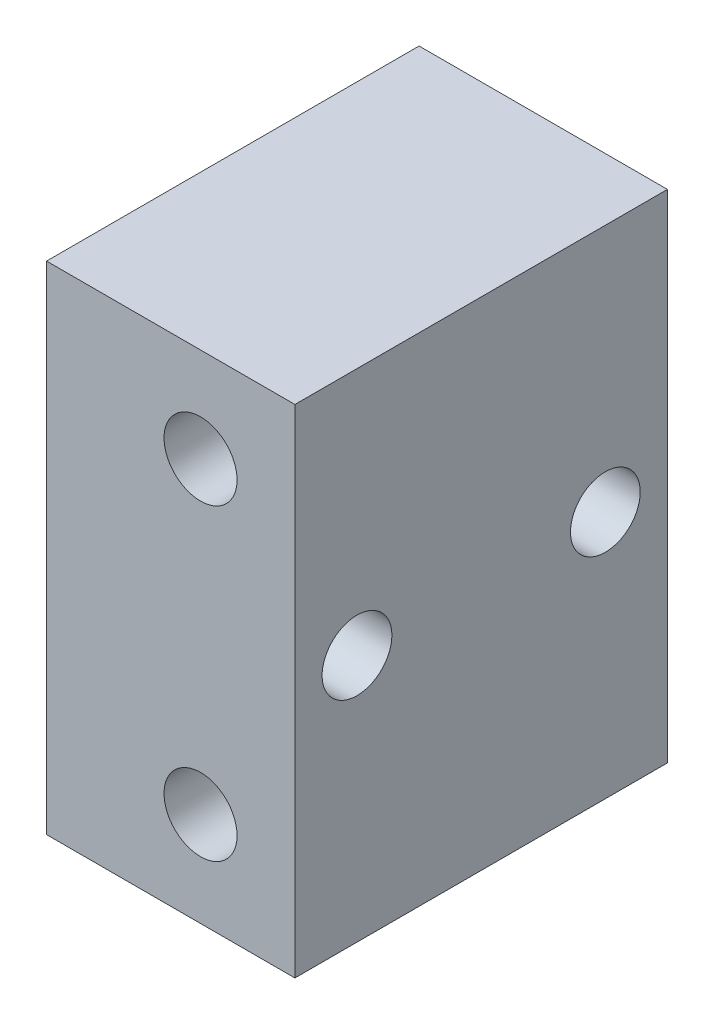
from build123d import *

# Parameters (mm, degrees)
SKETCH1_W                    = 12.7
SKETCH1_H                    = 25.4
EXTRUDE1_DEPTH               = 19.05
F_28_0_1405_DIAMETER_HOLE1_D = 3.5687
F_26_0_147_DIAMETER_HOLE1_D  = 3.7338


with BuildPart() as part:
    # Sketch1 → Extrude1 (new body)
    with BuildSketch(Plane.XY):
        with Locations((6.35, 12.7)):
            Rectangle(SKETCH1_W, SKETCH1_H)
    extrude(amount=EXTRUDE1_DEPTH)

    # 28 _0.1405_ Diameter Hole1 (through all)
    with Locations(Plane(origin=(12.7, 12.7, 15.875), x_dir=(0, 0, 1), z_dir=(1, 0, 0))):
        with Locations((0, 0), (-12.7, 0)):
            Hole(F_28_0_1405_DIAMETER_HOLE1_D / 2)

    # 26 _0.147_ Diameter Hole1 (through all)
    with Locations(Plane(origin=(7.874, 20.574, 19.05), x_dir=(1, 0, 0), z_dir=(0, 0, 1))):
        with Locations((0, 0), (0, -15.748)):
            Hole(F_26_0_147_DIAMETER_HOLE1_D / 2)


solid = part.part
